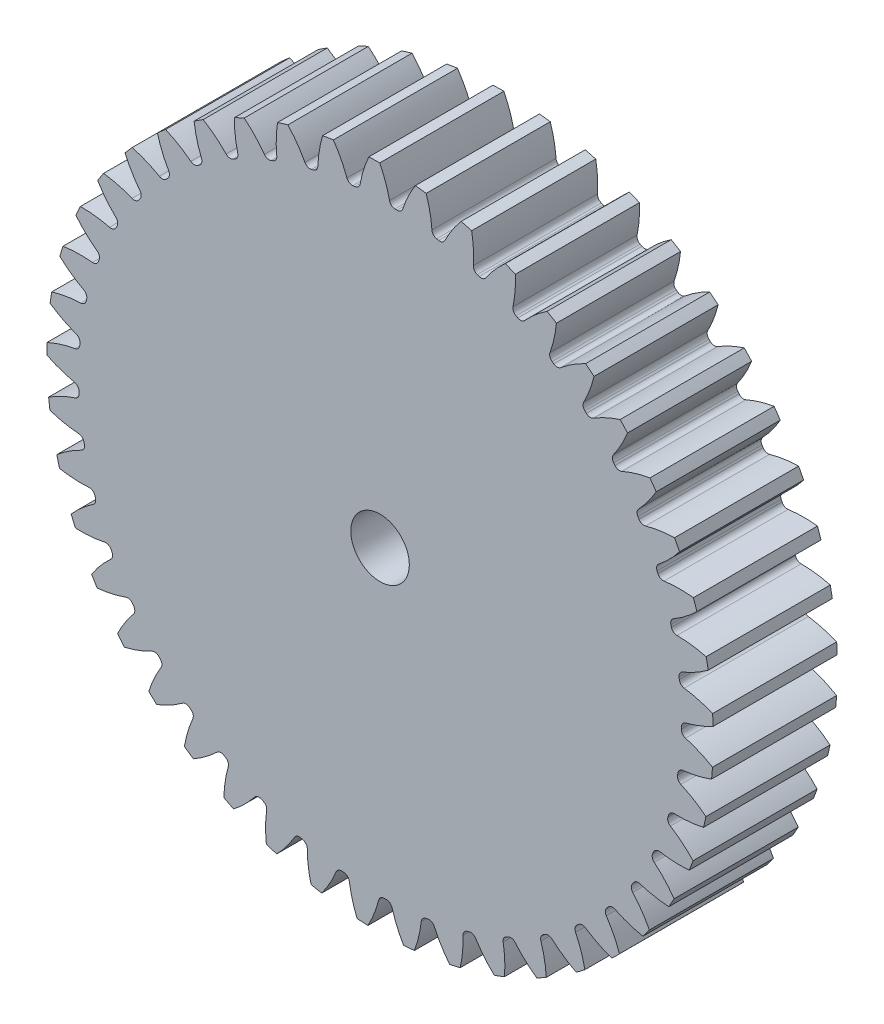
from build123d import *

# Parameters (mm, degrees)
SKETCH3_R         = 238.76
GEARBODY_DEPTH    = 88.9
TOOTHCUT_DEPTH    = 350.164553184
CIRPATTERN1_COUNT = 45
BOREDIA_R         = 20.955
BORE_DEPTH        = 12700


with BuildPart() as part:
    # Sketch3 → gearBody (new body)
    with BuildSketch(Plane.XY):
        Circle(SKETCH3_R)
    extrude(amount=GEARBODY_DEPTH)

    # Sketch2 → toothCut (cut, through all)
    with BuildSketch(Plane.XY):
        with BuildLine():
            ThreePointArc((215.851836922, -4.560098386), (215.866192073, -3.820617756), (215.878013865, -3.081092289))
            ThreePointArc((215.878013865, -3.081092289), (216.768600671, -0.575936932), (219.000328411, 0.869171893))
            ThreePointArc((219.000328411, 0.869171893), (229.12661499, 4.121546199), (238.76, 8.629041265))
            ThreePointArc((238.76, 8.629041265), (238.878468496, -4.227912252), (238.305106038, -17.072621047))
            ThreePointArc((238.305106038, -17.072621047), (228.837260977, -12.227053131), (218.832408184, -8.6183776))
            ThreePointArc((218.832408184, -8.6183776), (216.653216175, -7.095199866), (215.851836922, -4.560098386))
        make_face()
    toothcut = extrude(amount=TOOTHCUT_DEPTH, mode=Mode.SUBTRACT)

    # CirPattern1: toothCut ×45 about axis
    cirpattern1_axis = Axis((0, 0, 0), (0, 0, 1))
    for i in range(1, CIRPATTERN1_COUNT):
        add(toothcut.rotate(cirpattern1_axis, i * 360 / CIRPATTERN1_COUNT), mode=Mode.SUBTRACT)

    # boreDia → bore (cut, symmetric)
    with BuildSketch(Plane.XY):
        Circle(BOREDIA_R)
    extrude(amount=BORE_DEPTH, both=True, mode=Mode.SUBTRACT)


solid = part.part
